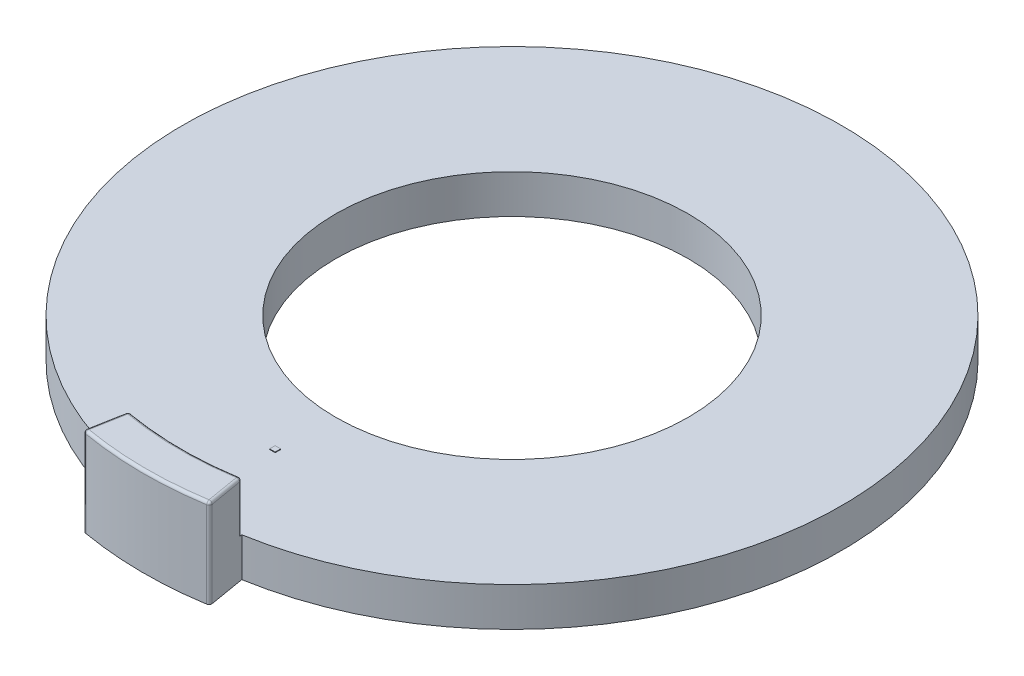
ISO-10303-21;
HEADER;
FILE_DESCRIPTION(('STEP AP214'),'2;1');
FILE_NAME('part.step','',(''),(''),'','','');
FILE_SCHEMA(('AUTOMOTIVE_DESIGN { 1 0 10303 214 1 1 1 1 }'));
ENDSEC;
DATA;
#1=APPLICATION_CONTEXT('core data for automotive mechanical design processes');
#2=APPLICATION_PROTOCOL_DEFINITION('international standard','automotive_design',2000,#1);
#3=PRODUCT_CONTEXT('',#1,'mechanical');
#4=PRODUCT('Part','Part','',(#3));
#5=PRODUCT_RELATED_PRODUCT_CATEGORY('part','',(#4));
#6=PRODUCT_DEFINITION_FORMATION('','',#4);
#7=PRODUCT_DEFINITION_CONTEXT('part definition',#1,'design');
#8=PRODUCT_DEFINITION('design','',#6,#7);
#9=PRODUCT_DEFINITION_SHAPE('','',#8);
#10=(LENGTH_UNIT() NAMED_UNIT(*) SI_UNIT(.MILLI.,.METRE.));
#11=(NAMED_UNIT(*) PLANE_ANGLE_UNIT() SI_UNIT($,.RADIAN.));
#12=(NAMED_UNIT(*) SI_UNIT($,.STERADIAN.) SOLID_ANGLE_UNIT());
#13=UNCERTAINTY_MEASURE_WITH_UNIT(LENGTH_MEASURE(1.E-05),#10,'distance_accuracy_value','');
#14=(GEOMETRIC_REPRESENTATION_CONTEXT(3) GLOBAL_UNCERTAINTY_ASSIGNED_CONTEXT((#13)) GLOBAL_UNIT_ASSIGNED_CONTEXT((#10,
#11,#12)) REPRESENTATION_CONTEXT('',''));
#15=CARTESIAN_POINT('',(0.,0.,0.));
#16=DIRECTION('',(0.,0.,1.));
#17=DIRECTION('',(1.,0.,0.));
#18=AXIS2_PLACEMENT_3D('',#15,#16,#17);
#19=CARTESIAN_POINT('',(0.,0.7,0.));
#20=DIRECTION('',(0.,1.,0.));
#21=DIRECTION('',(0.,0.,1.));
#22=AXIS2_PLACEMENT_3D('',#19,#20,#21);
#23=PLANE('',#22);
#24=CARTESIAN_POINT('',(0.,0.7,0.));
#25=DIRECTION('',(0.,1.,0.));
#26=DIRECTION('',(0.,0.,1.));
#27=AXIS2_PLACEMENT_3D('',#24,#25,#26);
#28=CIRCLE('',#27,3.175);
#29=CARTESIAN_POINT('',(0.,0.7,3.175));
#30=VERTEX_POINT('',#29);
#31=EDGE_CURVE('E196',#30,#30,#28,.T.);
#32=ORIENTED_EDGE('',*,*,#31,.F.);
#33=EDGE_LOOP('',(#32));
#34=FACE_BOUND('',#33,.T.);
#35=DIRECTION('',(-1.,0.,0.));
#36=VECTOR('',#35,1.);
#37=CARTESIAN_POINT('',(-0.0937750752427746,0.7,4.17188014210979));
#38=LINE('',#37,#36);
#39=CARTESIAN_POINT('',(0.00622492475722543,0.7,4.17188014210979));
#40=VERTEX_POINT('',#39);
#41=CARTESIAN_POINT('',(-0.0937750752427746,0.7,4.17188014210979));
#42=VERTEX_POINT('',#41);
#43=EDGE_CURVE('E227',#40,#42,#38,.T.);
#44=ORIENTED_EDGE('',*,*,#43,.F.);
#45=DIRECTION('',(0.,0.,-1.));
#46=VECTOR('',#45,1.);
#47=CARTESIAN_POINT('',(0.00622492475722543,0.7,4.17188014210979));
#48=LINE('',#47,#46);
#49=CARTESIAN_POINT('',(0.00622492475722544,0.7,4.27188014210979));
#50=VERTEX_POINT('',#49);
#51=EDGE_CURVE('E212',#50,#40,#48,.T.);
#52=ORIENTED_EDGE('',*,*,#51,.F.);
#53=DIRECTION('',(1.,0.,0.));
#54=VECTOR('',#53,1.);
#55=CARTESIAN_POINT('',(-0.0937750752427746,0.7,4.27188014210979));
#56=LINE('',#55,#54);
#57=CARTESIAN_POINT('',(-0.0937750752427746,0.7,4.27188014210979));
#58=VERTEX_POINT('',#57);
#59=EDGE_CURVE('E218',#58,#50,#56,.T.);
#60=ORIENTED_EDGE('',*,*,#59,.F.);
#61=DIRECTION('',(0.,0.,1.));
#62=VECTOR('',#61,1.);
#63=CARTESIAN_POINT('',(-0.0937750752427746,0.7,4.17188014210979));
#64=LINE('',#63,#62);
#65=EDGE_CURVE('E229',#42,#58,#64,.T.);
#66=ORIENTED_EDGE('',*,*,#65,.F.);
#67=EDGE_LOOP('',(#44,#52,#60,#66));
#68=FACE_BOUND('',#67,.T.);
#69=CARTESIAN_POINT('',(0.,0.7,0.));
#70=DIRECTION('',(0.,1.,0.));
#71=DIRECTION('',(0.,0.,1.));
#72=AXIS2_PLACEMENT_3D('',#69,#70,#71);
#73=CIRCLE('',#72,5.935);
#74=CARTESIAN_POINT('',(0.98573466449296,0.7,5.85256799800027));
#75=VERTEX_POINT('',#74);
#76=CARTESIAN_POINT('',(-1.06389441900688,0.7,5.8388657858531));
#77=VERTEX_POINT('',#76);
#78=EDGE_CURVE('E195',#75,#77,#73,.T.);
#79=ORIENTED_EDGE('',*,*,#78,.T.);
#80=DIRECTION('',(-0.179257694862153,0.,0.983802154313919));
#81=VECTOR('',#80,1.);
#82=CARTESIAN_POINT('',(-1.06389441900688,0.7,5.83886578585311));
#83=LINE('',#82,#81);
#84=CARTESIAN_POINT('',(-1.07281986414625,0.7,5.88785041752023));
#85=VERTEX_POINT('',#84);
#86=EDGE_CURVE('E293',#85,#77,#83,.F.);
#87=ORIENTED_EDGE('',*,*,#86,.F.);
#88=CARTESIAN_POINT('',(-1.02362975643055,0.7,5.89681330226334));
#89=DIRECTION('',(0.,1.,0.));
#90=DIRECTION('',(0.,0.,1.));
#91=AXIS2_PLACEMENT_3D('',#88,#89,#90);
#92=CIRCLE('',#91,0.05);
#93=CARTESIAN_POINT('',(-1.0150781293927,0.7,5.84755003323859));
#94=VERTEX_POINT('',#93);
#95=EDGE_CURVE('E69',#85,#94,#92,.F.);
#96=ORIENTED_EDGE('',*,*,#95,.T.);
#97=CARTESIAN_POINT('',(0.,0.7,0.));
#98=DIRECTION('',(0.,-1.,0.));
#99=DIRECTION('',(0.,0.,1.));
#100=AXIS2_PLACEMENT_3D('',#97,#98,#99);
#101=CIRCLE('',#100,5.935);
#102=CARTESIAN_POINT('',(0.936806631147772,0.7,5.86059880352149));
#103=VERTEX_POINT('',#102);
#104=EDGE_CURVE('E208',#103,#94,#101,.T.);
#105=ORIENTED_EDGE('',*,*,#104,.F.);
#106=CARTESIAN_POINT('',(0.944698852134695,0.7,5.90997200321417));
#107=DIRECTION('',(0.,1.,0.));
#108=DIRECTION('',(0.,0.,1.));
#109=AXIS2_PLACEMENT_3D('',#106,#107,#108);
#110=CIRCLE('',#109,0.05);
#111=CARTESIAN_POINT('',(0.994004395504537,0.7,5.90166758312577));
#112=VERTEX_POINT('',#111);
#113=EDGE_CURVE('E13',#103,#112,#110,.F.);
#114=ORIENTED_EDGE('',*,*,#113,.T.);
#115=DIRECTION('',(-0.16608840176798,0.,-0.986110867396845));
#116=VECTOR('',#115,1.);
#117=CARTESIAN_POINT('',(0.98573466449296,0.7,5.85256799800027));
#118=LINE('',#117,#116);
#119=EDGE_CURVE('E76',#75,#112,#118,.F.);
#120=ORIENTED_EDGE('',*,*,#119,.F.);
#121=EDGE_LOOP('',(#79,#87,#96,#105,#114,#120));
#122=FACE_BOUND('',#121,.T.);
#123=ADVANCED_FACE('F60',(#34,#68,#122),#23,.T.);
#124=CARTESIAN_POINT('',(0.,0.,0.));
#125=DIRECTION('',(0.,1.,0.));
#126=DIRECTION('',(0.,0.,1.));
#127=AXIS2_PLACEMENT_3D('',#124,#125,#126);
#128=PLANE('',#127);
#129=CARTESIAN_POINT('',(0.,0.,0.));
#130=DIRECTION('',(0.,-1.,0.));
#131=DIRECTION('',(0.,0.,-1.));
#132=AXIS2_PLACEMENT_3D('',#129,#130,#131);
#133=CIRCLE('',#132,6.635);
#134=CARTESIAN_POINT('',(-1.13977690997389,0.,6.53637006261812));
#135=VERTEX_POINT('',#134);
#136=CARTESIAN_POINT('',(1.05228485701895,0.,6.55102446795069));
#137=VERTEX_POINT('',#136);
#138=EDGE_CURVE('E200',#135,#137,#133,.F.);
#139=ORIENTED_EDGE('',*,*,#138,.F.);
#140=CARTESIAN_POINT('',(-1.13118778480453,0.,6.48711331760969));
#141=DIRECTION('',(0.,1.,0.));
#142=DIRECTION('',(0.,0.,1.));
#143=AXIS2_PLACEMENT_3D('',#140,#141,#142);
#144=CIRCLE('',#143,0.05);
#145=CARTESIAN_POINT('',(-1.18037789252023,0.,6.47815043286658));
#146=VERTEX_POINT('',#145);
#147=EDGE_CURVE('E308',#135,#146,#144,.F.);
#148=ORIENTED_EDGE('',*,*,#147,.T.);
#149=DIRECTION('',(0.179257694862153,0.,-0.983802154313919));
#150=VECTOR('',#149,1.);
#151=CARTESIAN_POINT('',(-1.06389441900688,0.,5.83886578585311));
#152=LINE('',#151,#150);
#153=CARTESIAN_POINT('',(-1.06389441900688,0.,5.83886578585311));
#154=VERTEX_POINT('',#153);
#155=EDGE_CURVE('E183',#146,#154,#152,.T.);
#156=ORIENTED_EDGE('',*,*,#155,.T.);
#157=CARTESIAN_POINT('',(0.,0.,0.));
#158=DIRECTION('',(0.,1.,0.));
#159=DIRECTION('',(0.,0.,1.));
#160=AXIS2_PLACEMENT_3D('',#157,#158,#159);
#161=CIRCLE('',#160,5.935);
#162=CARTESIAN_POINT('',(0.985734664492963,0.,5.85256799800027));
#163=VERTEX_POINT('',#162);
#164=EDGE_CURVE('E187',#163,#154,#161,.T.);
#165=ORIENTED_EDGE('',*,*,#164,.F.);
#166=DIRECTION('',(-0.16608840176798,0.,-0.986110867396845));
#167=VECTOR('',#166,1.);
#168=CARTESIAN_POINT('',(0.985734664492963,0.,5.85256799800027));
#169=LINE('',#168,#167);
#170=CARTESIAN_POINT('',(1.09366059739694,0.,6.49335287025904));
#171=VERTEX_POINT('',#170);
#172=EDGE_CURVE('E172',#171,#163,#169,.T.);
#173=ORIENTED_EDGE('',*,*,#172,.F.);
#174=CARTESIAN_POINT('',(1.0443550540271,0.,6.50165729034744));
#175=DIRECTION('',(0.,1.,0.));
#176=DIRECTION('',(0.,0.,1.));
#177=AXIS2_PLACEMENT_3D('',#174,#175,#176);
#178=CIRCLE('',#177,0.05);
#179=EDGE_CURVE('E306',#171,#137,#178,.F.);
#180=ORIENTED_EDGE('',*,*,#179,.T.);
#181=EDGE_LOOP('',(#139,#148,#156,#165,#173,#180));
#182=FACE_BOUND('',#181,.T.);
#183=CARTESIAN_POINT('',(0.,0.,0.));
#184=DIRECTION('',(0.,1.,0.));
#185=DIRECTION('',(0.,0.,1.));
#186=AXIS2_PLACEMENT_3D('',#183,#184,#185);
#187=CIRCLE('',#186,3.175);
#188=CARTESIAN_POINT('',(0.,0.,3.175));
#189=VERTEX_POINT('',#188);
#190=EDGE_CURVE('E242',#189,#189,#187,.T.);
#191=ORIENTED_EDGE('',*,*,#190,.T.);
#192=EDGE_LOOP('',(#191));
#193=FACE_BOUND('',#192,.T.);
#194=ADVANCED_FACE('F189',(#182,#193),#128,.F.);
#195=CARTESIAN_POINT('',(0.,0.7,0.));
#196=DIRECTION('',(0.,-1.,0.));
#197=DIRECTION('',(0.,0.,-1.));
#198=AXIS2_PLACEMENT_3D('',#195,#196,#197);
#199=CYLINDRICAL_SURFACE('',#198,5.935);
#200=ORIENTED_EDGE('',*,*,#164,.T.);
#201=DIRECTION('',(0.,1.,0.));
#202=VECTOR('',#201,1.);
#203=CARTESIAN_POINT('',(-1.06389441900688,0.,5.83886578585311));
#204=LINE('',#203,#202);
#205=EDGE_CURVE('E184',#154,#77,#204,.T.);
#206=ORIENTED_EDGE('',*,*,#205,.T.);
#207=ORIENTED_EDGE('',*,*,#78,.F.);
#208=DIRECTION('',(0.,-1.,0.));
#209=VECTOR('',#208,1.);
#210=CARTESIAN_POINT('',(0.98573466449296,0.700000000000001,5.85256799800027));
#211=LINE('',#210,#209);
#212=EDGE_CURVE('E176',#75,#163,#211,.T.);
#213=ORIENTED_EDGE('',*,*,#212,.T.);
#214=EDGE_LOOP('',(#200,#206,#207,#213));
#215=FACE_BOUND('',#214,.T.);
#216=ADVANCED_FACE('F198',(#215),#199,.T.);
#217=CARTESIAN_POINT('',(0.,0.7,0.));
#218=DIRECTION('',(0.,-1.,0.));
#219=DIRECTION('',(0.,0.,-1.));
#220=AXIS2_PLACEMENT_3D('',#217,#218,#219);
#221=CYLINDRICAL_SURFACE('',#220,3.175);
#222=ORIENTED_EDGE('',*,*,#31,.T.);
#223=EDGE_LOOP('',(#222));
#224=FACE_BOUND('',#223,.T.);
#225=ORIENTED_EDGE('',*,*,#190,.F.);
#226=EDGE_LOOP('',(#225));
#227=FACE_BOUND('',#226,.T.);
#228=ADVANCED_FACE('F400',(#224,#227),#221,.F.);
#229=CARTESIAN_POINT('',(0.00622492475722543,0.71,4.17188014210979));
#230=DIRECTION('',(-1.,0.,0.));
#231=DIRECTION('',(0.,0.,1.));
#232=AXIS2_PLACEMENT_3D('',#229,#230,#231);
#233=PLANE('',#232);
#234=ORIENTED_EDGE('',*,*,#51,.T.);
#235=DIRECTION('',(0.,-1.,0.));
#236=VECTOR('',#235,1.);
#237=CARTESIAN_POINT('',(0.00622492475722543,0.71,4.17188014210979));
#238=LINE('',#237,#236);
#239=CARTESIAN_POINT('',(0.00622492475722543,0.71,4.17188014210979));
#240=VERTEX_POINT('',#239);
#241=EDGE_CURVE('E240',#240,#40,#238,.T.);
#242=ORIENTED_EDGE('',*,*,#241,.F.);
#243=DIRECTION('',(0.,0.,-1.));
#244=VECTOR('',#243,1.);
#245=CARTESIAN_POINT('',(0.00622492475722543,0.71,4.17188014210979));
#246=LINE('',#245,#244);
#247=CARTESIAN_POINT('',(0.00622492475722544,0.71,4.27188014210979));
#248=VERTEX_POINT('',#247);
#249=EDGE_CURVE('E214',#248,#240,#246,.T.);
#250=ORIENTED_EDGE('',*,*,#249,.F.);
#251=DIRECTION('',(0.,-1.,0.));
#252=VECTOR('',#251,1.);
#253=CARTESIAN_POINT('',(0.00622492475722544,0.71,4.27188014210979));
#254=LINE('',#253,#252);
#255=EDGE_CURVE('E224',#248,#50,#254,.T.);
#256=ORIENTED_EDGE('',*,*,#255,.T.);
#257=EDGE_LOOP('',(#234,#242,#250,#256));
#258=FACE_BOUND('',#257,.T.);
#259=ADVANCED_FACE('F554',(#258),#233,.F.);
#260=CARTESIAN_POINT('',(-0.0937750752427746,0.71,4.17188014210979));
#261=DIRECTION('',(0.,0.,1.));
#262=DIRECTION('',(1.,0.,0.));
#263=AXIS2_PLACEMENT_3D('',#260,#261,#262);
#264=PLANE('',#263);
#265=ORIENTED_EDGE('',*,*,#43,.T.);
#266=DIRECTION('',(0.,-1.,0.));
#267=VECTOR('',#266,1.);
#268=CARTESIAN_POINT('',(-0.0937750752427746,0.71,4.17188014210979));
#269=LINE('',#268,#267);
#270=CARTESIAN_POINT('',(-0.0937750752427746,0.71,4.17188014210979));
#271=VERTEX_POINT('',#270);
#272=EDGE_CURVE('E237',#271,#42,#269,.T.);
#273=ORIENTED_EDGE('',*,*,#272,.F.);
#274=DIRECTION('',(-1.,0.,0.));
#275=VECTOR('',#274,1.);
#276=CARTESIAN_POINT('',(-0.0937750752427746,0.71,4.17188014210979));
#277=LINE('',#276,#275);
#278=EDGE_CURVE('E217',#240,#271,#277,.T.);
#279=ORIENTED_EDGE('',*,*,#278,.F.);
#280=ORIENTED_EDGE('',*,*,#241,.T.);
#281=EDGE_LOOP('',(#265,#273,#279,#280));
#282=FACE_BOUND('',#281,.T.);
#283=ADVANCED_FACE('F544',(#282),#264,.F.);
#284=CARTESIAN_POINT('',(-0.0937750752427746,0.71,4.17188014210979));
#285=DIRECTION('',(1.,0.,0.));
#286=DIRECTION('',(0.,0.,-1.));
#287=AXIS2_PLACEMENT_3D('',#284,#285,#286);
#288=PLANE('',#287);
#289=ORIENTED_EDGE('',*,*,#65,.T.);
#290=DIRECTION('',(0.,-1.,0.));
#291=VECTOR('',#290,1.);
#292=CARTESIAN_POINT('',(-0.0937750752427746,0.71,4.27188014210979));
#293=LINE('',#292,#291);
#294=CARTESIAN_POINT('',(-0.0937750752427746,0.71,4.27188014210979));
#295=VERTEX_POINT('',#294);
#296=EDGE_CURVE('E235',#295,#58,#293,.T.);
#297=ORIENTED_EDGE('',*,*,#296,.F.);
#298=DIRECTION('',(0.,0.,1.));
#299=VECTOR('',#298,1.);
#300=CARTESIAN_POINT('',(-0.0937750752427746,0.71,4.17188014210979));
#301=LINE('',#300,#299);
#302=EDGE_CURVE('E220',#271,#295,#301,.T.);
#303=ORIENTED_EDGE('',*,*,#302,.F.);
#304=ORIENTED_EDGE('',*,*,#272,.T.);
#305=EDGE_LOOP('',(#289,#297,#303,#304));
#306=FACE_BOUND('',#305,.T.);
#307=ADVANCED_FACE('F534',(#306),#288,.F.);
#308=CARTESIAN_POINT('',(-0.0937750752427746,0.71,4.27188014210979));
#309=DIRECTION('',(0.,0.,-1.));
#310=DIRECTION('',(-1.,0.,0.));
#311=AXIS2_PLACEMENT_3D('',#308,#309,#310);
#312=PLANE('',#311);
#313=ORIENTED_EDGE('',*,*,#59,.T.);
#314=ORIENTED_EDGE('',*,*,#255,.F.);
#315=DIRECTION('',(1.,0.,0.));
#316=VECTOR('',#315,1.);
#317=CARTESIAN_POINT('',(-0.0937750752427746,0.71,4.27188014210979));
#318=LINE('',#317,#316);
#319=EDGE_CURVE('E222',#295,#248,#318,.T.);
#320=ORIENTED_EDGE('',*,*,#319,.F.);
#321=ORIENTED_EDGE('',*,*,#296,.T.);
#322=EDGE_LOOP('',(#313,#314,#320,#321));
#323=FACE_BOUND('',#322,.T.);
#324=ADVANCED_FACE('F387',(#323),#312,.F.);
#325=CARTESIAN_POINT('',(0.,0.71,0.));
#326=DIRECTION('',(0.,1.,0.));
#327=DIRECTION('',(0.,0.,1.));
#328=AXIS2_PLACEMENT_3D('',#325,#326,#327);
#329=PLANE('',#328);
#330=ORIENTED_EDGE('',*,*,#249,.T.);
#331=ORIENTED_EDGE('',*,*,#278,.T.);
#332=ORIENTED_EDGE('',*,*,#302,.T.);
#333=ORIENTED_EDGE('',*,*,#319,.T.);
#334=EDGE_LOOP('',(#330,#331,#332,#333));
#335=FACE_BOUND('',#334,.T.);
#336=ADVANCED_FACE('F380',(#335),#329,.T.);
#337=CARTESIAN_POINT('',(-1.06389441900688,0.35,5.83886578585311));
#338=DIRECTION('',(0.983802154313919,0.,0.179257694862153));
#339=DIRECTION('',(0.,1.,0.));
#340=AXIS2_PLACEMENT_3D('',#337,#338,#339);
#341=PLANE('',#340);
#342=DIRECTION('',(-0.179257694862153,0.,0.983802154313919));
#343=VECTOR('',#342,1.);
#344=CARTESIAN_POINT('',(-1.06389441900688,1.55,5.83886578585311));
#345=LINE('',#344,#343);
#346=CARTESIAN_POINT('',(-1.18037789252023,1.55,6.47815043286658));
#347=VERTEX_POINT('',#346);
#348=CARTESIAN_POINT('',(-1.07281986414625,1.55,5.88785041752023));
#349=VERTEX_POINT('',#348);
#350=EDGE_CURVE('E260',#347,#349,#345,.F.);
#351=ORIENTED_EDGE('',*,*,#350,.T.);
#352=DIRECTION('',(0.,-1.,0.));
#353=VECTOR('',#352,1.);
#354=CARTESIAN_POINT('',(-1.07281986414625,0.7,5.88785041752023));
#355=LINE('',#354,#353);
#356=EDGE_CURVE('E295',#349,#85,#355,.T.);
#357=ORIENTED_EDGE('',*,*,#356,.T.);
#358=ORIENTED_EDGE('',*,*,#86,.T.);
#359=ORIENTED_EDGE('',*,*,#205,.F.);
#360=ORIENTED_EDGE('',*,*,#155,.F.);
#361=DIRECTION('',(0.,-1.,0.));
#362=VECTOR('',#361,1.);
#363=CARTESIAN_POINT('',(-1.18037789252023,1.55,6.47815043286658));
#364=LINE('',#363,#362);
#365=EDGE_CURVE('E291',#146,#347,#364,.F.);
#366=ORIENTED_EDGE('',*,*,#365,.T.);
#367=EDGE_LOOP('',(#351,#357,#358,#359,#360,#366));
#368=FACE_BOUND('',#367,.T.);
#369=ADVANCED_FACE('F378',(#368),#341,.F.);
#370=CARTESIAN_POINT('',(0.98573466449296,0.35,5.85256799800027));
#371=DIRECTION('',(-0.986110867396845,0.,0.16608840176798));
#372=DIRECTION('',(0.,-1.,0.));
#373=AXIS2_PLACEMENT_3D('',#370,#371,#372);
#374=PLANE('',#373);
#375=ORIENTED_EDGE('',*,*,#212,.F.);
#376=ORIENTED_EDGE('',*,*,#119,.T.);
#377=DIRECTION('',(0.,-1.,0.));
#378=VECTOR('',#377,1.);
#379=CARTESIAN_POINT('',(0.994004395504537,1.55,5.90166758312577));
#380=LINE('',#379,#378);
#381=CARTESIAN_POINT('',(0.994004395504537,1.55,5.90166758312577));
#382=VERTEX_POINT('',#381);
#383=EDGE_CURVE('E311',#112,#382,#380,.F.);
#384=ORIENTED_EDGE('',*,*,#383,.T.);
#385=DIRECTION('',(-0.16608840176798,0.,-0.986110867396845));
#386=VECTOR('',#385,1.);
#387=CARTESIAN_POINT('',(0.98573466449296,1.55,5.85256799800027));
#388=LINE('',#387,#386);
#389=CARTESIAN_POINT('',(1.09366059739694,1.55,6.49335287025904));
#390=VERTEX_POINT('',#389);
#391=EDGE_CURVE('E266',#382,#390,#388,.F.);
#392=ORIENTED_EDGE('',*,*,#391,.T.);
#393=DIRECTION('',(0.,-1.,0.));
#394=VECTOR('',#393,1.);
#395=CARTESIAN_POINT('',(1.09366059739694,0.,6.49335287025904));
#396=LINE('',#395,#394);
#397=EDGE_CURVE('E180',#390,#171,#396,.T.);
#398=ORIENTED_EDGE('',*,*,#397,.T.);
#399=ORIENTED_EDGE('',*,*,#172,.T.);
#400=EDGE_LOOP('',(#375,#376,#384,#392,#398,#399));
#401=FACE_BOUND('',#400,.T.);
#402=ADVANCED_FACE('F174',(#401),#374,.F.);
#403=CARTESIAN_POINT('',(0.,0.7,0.));
#404=DIRECTION('',(0.,-1.,0.));
#405=DIRECTION('',(0.,0.,-1.));
#406=AXIS2_PLACEMENT_3D('',#403,#404,#405);
#407=CYLINDRICAL_SURFACE('',#406,6.635);
#408=CARTESIAN_POINT('',(0.,1.55,0.));
#409=DIRECTION('',(0.,1.,0.));
#410=DIRECTION('',(0.,0.,1.));
#411=AXIS2_PLACEMENT_3D('',#408,#409,#410);
#412=CIRCLE('',#411,6.635);
#413=CARTESIAN_POINT('',(1.05228485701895,1.55,6.55102446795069));
#414=VERTEX_POINT('',#413);
#415=CARTESIAN_POINT('',(-1.13977690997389,1.55,6.53637006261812));
#416=VERTEX_POINT('',#415);
#417=EDGE_CURVE('E268',#414,#416,#412,.F.);
#418=ORIENTED_EDGE('',*,*,#417,.T.);
#419=DIRECTION('',(0.,-1.,0.));
#420=VECTOR('',#419,1.);
#421=CARTESIAN_POINT('',(-1.13977690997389,0.7,6.53637006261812));
#422=LINE('',#421,#420);
#423=EDGE_CURVE('E304',#416,#135,#422,.T.);
#424=ORIENTED_EDGE('',*,*,#423,.T.);
#425=ORIENTED_EDGE('',*,*,#138,.T.);
#426=DIRECTION('',(0.,-1.,0.));
#427=VECTOR('',#426,1.);
#428=CARTESIAN_POINT('',(1.05228485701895,0.7,6.55102446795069));
#429=LINE('',#428,#427);
#430=EDGE_CURVE('E302',#137,#414,#429,.F.);
#431=ORIENTED_EDGE('',*,*,#430,.T.);
#432=EDGE_LOOP('',(#418,#424,#425,#431));
#433=FACE_BOUND('',#432,.T.);
#434=ADVANCED_FACE('F334',(#433),#407,.T.);
#435=CARTESIAN_POINT('',(0.,1.6,0.));
#436=DIRECTION('',(0.,-1.,0.));
#437=DIRECTION('',(0.,0.,-1.));
#438=AXIS2_PLACEMENT_3D('',#435,#436,#437);
#439=CYLINDRICAL_SURFACE('',#438,5.935);
#440=ORIENTED_EDGE('',*,*,#104,.T.);
#441=DIRECTION('',(0.,-1.,0.));
#442=VECTOR('',#441,1.);
#443=CARTESIAN_POINT('',(-1.0150781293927,1.6,5.84755003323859));
#444=LINE('',#443,#442);
#445=CARTESIAN_POINT('',(-1.0150781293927,1.55,5.84755003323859));
#446=VERTEX_POINT('',#445);
#447=EDGE_CURVE('E300',#94,#446,#444,.F.);
#448=ORIENTED_EDGE('',*,*,#447,.T.);
#449=CARTESIAN_POINT('',(0.,1.55,0.));
#450=DIRECTION('',(0.,1.,0.));
#451=DIRECTION('',(0.,0.,1.));
#452=AXIS2_PLACEMENT_3D('',#449,#450,#451);
#453=CIRCLE('',#452,5.935);
#454=CARTESIAN_POINT('',(0.936806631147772,1.55,5.86059880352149));
#455=VERTEX_POINT('',#454);
#456=EDGE_CURVE('E263',#446,#455,#453,.T.);
#457=ORIENTED_EDGE('',*,*,#456,.T.);
#458=DIRECTION('',(0.,-1.,0.));
#459=VECTOR('',#458,1.);
#460=CARTESIAN_POINT('',(0.936806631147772,1.6,5.86059880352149));
#461=LINE('',#460,#459);
#462=EDGE_CURVE('E298',#455,#103,#461,.T.);
#463=ORIENTED_EDGE('',*,*,#462,.T.);
#464=EDGE_LOOP('',(#440,#448,#457,#463));
#465=FACE_BOUND('',#464,.T.);
#466=ADVANCED_FACE('F368',(#465),#439,.F.);
#467=CARTESIAN_POINT('',(0.,1.6,0.));
#468=DIRECTION('',(0.,1.,0.));
#469=DIRECTION('',(0.,0.,1.));
#470=AXIS2_PLACEMENT_3D('',#467,#468,#469);
#471=PLANE('',#470);
#472=CARTESIAN_POINT('',(0.,1.6,0.));
#473=DIRECTION('',(0.,1.,0.));
#474=DIRECTION('',(0.,0.,1.));
#475=AXIS2_PLACEMENT_3D('',#472,#473,#474);
#476=CIRCLE('',#475,5.985);
#477=CARTESIAN_POINT('',(0.944698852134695,1.6,5.90997200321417));
#478=VERTEX_POINT('',#477);
#479=CARTESIAN_POINT('',(-1.02362975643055,1.6,5.89681330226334));
#480=VERTEX_POINT('',#479);
#481=EDGE_CURVE('E254',#478,#480,#476,.F.);
#482=ORIENTED_EDGE('',*,*,#481,.T.);
#483=DIRECTION('',(0.179257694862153,0.,-0.983802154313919));
#484=VECTOR('',#483,1.);
#485=CARTESIAN_POINT('',(0.0491901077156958,1.6,0.00896288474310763));
#486=LINE('',#485,#484);
#487=CARTESIAN_POINT('',(-1.13118778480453,1.6,6.48711331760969));
#488=VERTEX_POINT('',#487);
#489=EDGE_CURVE('E257',#480,#488,#486,.F.);
#490=ORIENTED_EDGE('',*,*,#489,.T.);
#491=CARTESIAN_POINT('',(0.,1.6,0.));
#492=DIRECTION('',(0.,1.,0.));
#493=DIRECTION('',(0.,0.,1.));
#494=AXIS2_PLACEMENT_3D('',#491,#492,#493);
#495=CIRCLE('',#494,6.585);
#496=CARTESIAN_POINT('',(1.0443550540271,1.6,6.50165729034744));
#497=VERTEX_POINT('',#496);
#498=EDGE_CURVE('E247',#488,#497,#495,.T.);
#499=ORIENTED_EDGE('',*,*,#498,.T.);
#500=DIRECTION('',(0.16608840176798,0.,0.986110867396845));
#501=VECTOR('',#500,1.);
#502=CARTESIAN_POINT('',(-0.0493055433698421,1.6,0.00830442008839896));
#503=LINE('',#502,#501);
#504=EDGE_CURVE('E251',#497,#478,#503,.F.);
#505=ORIENTED_EDGE('',*,*,#504,.T.);
#506=EDGE_LOOP('',(#482,#490,#499,#505));
#507=FACE_BOUND('',#506,.T.);
#508=ADVANCED_FACE('F354',(#507),#471,.T.);
#509=CARTESIAN_POINT('',(-0.0493055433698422,1.55,0.00830442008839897));
#510=DIRECTION('',(0.16608840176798,0.,0.986110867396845));
#511=DIRECTION('',(0.986110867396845,0.,-0.16608840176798));
#512=AXIS2_PLACEMENT_3D('',#509,#510,#511);
#513=CYLINDRICAL_SURFACE('',#512,0.05);
#514=ORIENTED_EDGE('',*,*,#391,.F.);
#515=CARTESIAN_POINT('',(0.944698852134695,1.55,5.90997200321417));
#516=DIRECTION('',(0.16608840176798,0.,0.986110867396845));
#517=DIRECTION('',(0.986110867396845,0.,-0.16608840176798));
#518=AXIS2_PLACEMENT_3D('',#515,#516,#517);
#519=CIRCLE('',#518,0.05);
#520=EDGE_CURVE('E289',#382,#478,#519,.T.);
#521=ORIENTED_EDGE('',*,*,#520,.T.);
#522=ORIENTED_EDGE('',*,*,#504,.F.);
#523=CARTESIAN_POINT('',(1.0443550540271,1.55,6.50165729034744));
#524=DIRECTION('',(0.16608840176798,0.,0.986110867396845));
#525=DIRECTION('',(0.986110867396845,0.,-0.16608840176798));
#526=AXIS2_PLACEMENT_3D('',#523,#524,#525);
#527=CIRCLE('',#526,0.05);
#528=EDGE_CURVE('E287',#497,#390,#527,.F.);
#529=ORIENTED_EDGE('',*,*,#528,.T.);
#530=EDGE_LOOP('',(#514,#521,#522,#529));
#531=FACE_BOUND('',#530,.T.);
#532=ADVANCED_FACE('F411',(#531),#513,.T.);
#533=CARTESIAN_POINT('',(0.,1.55,0.));
#534=DIRECTION('',(0.,1.,0.));
#535=DIRECTION('',(0.,0.,1.));
#536=AXIS2_PLACEMENT_3D('',#533,#534,#535);
#537=TOROIDAL_SURFACE('',#536,5.985,0.05);
#538=ORIENTED_EDGE('',*,*,#456,.F.);
#539=CARTESIAN_POINT('',(-1.02362975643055,1.55,5.89681330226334));
#540=DIRECTION('',(0.985265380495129,0.,0.171032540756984));
#541=DIRECTION('',(0.171032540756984,0.,-0.985265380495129));
#542=AXIS2_PLACEMENT_3D('',#539,#540,#541);
#543=CIRCLE('',#542,0.05);
#544=EDGE_CURVE('E280',#446,#480,#543,.T.);
#545=ORIENTED_EDGE('',*,*,#544,.T.);
#546=ORIENTED_EDGE('',*,*,#481,.F.);
#547=CARTESIAN_POINT('',(0.944698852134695,1.55,5.90997200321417));
#548=DIRECTION('',(0.987463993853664,0.,-0.157844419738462));
#549=DIRECTION('',(-0.157844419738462,0.,-0.987463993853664));
#550=AXIS2_PLACEMENT_3D('',#547,#548,#549);
#551=CIRCLE('',#550,0.05);
#552=EDGE_CURVE('E277',#478,#455,#551,.F.);
#553=ORIENTED_EDGE('',*,*,#552,.T.);
#554=EDGE_LOOP('',(#538,#545,#546,#553));
#555=FACE_BOUND('',#554,.T.);
#556=ADVANCED_FACE('F358',(#555),#537,.T.);
#557=CARTESIAN_POINT('',(0.,1.55,0.));
#558=DIRECTION('',(0.,1.,0.));
#559=DIRECTION('',(0.,0.,1.));
#560=AXIS2_PLACEMENT_3D('',#557,#558,#559);
#561=TOROIDAL_SURFACE('',#560,6.585,0.05);
#562=ORIENTED_EDGE('',*,*,#498,.F.);
#563=CARTESIAN_POINT('',(-1.13118778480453,1.55,6.48711331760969));
#564=DIRECTION('',(0.985134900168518,0.,0.171782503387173));
#565=DIRECTION('',(0.171782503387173,0.,-0.985134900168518));
#566=AXIS2_PLACEMENT_3D('',#563,#564,#565);
#567=CIRCLE('',#566,0.05);
#568=EDGE_CURVE('E285',#488,#416,#567,.T.);
#569=ORIENTED_EDGE('',*,*,#568,.T.);
#570=ORIENTED_EDGE('',*,*,#417,.F.);
#571=CARTESIAN_POINT('',(1.0443550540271,1.55,6.50165729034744));
#572=DIRECTION('',(0.987343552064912,0.,-0.158596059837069));
#573=DIRECTION('',(-0.158596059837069,0.,-0.987343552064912));
#574=AXIS2_PLACEMENT_3D('',#571,#572,#573);
#575=CIRCLE('',#574,0.05);
#576=EDGE_CURVE('E282',#414,#497,#575,.F.);
#577=ORIENTED_EDGE('',*,*,#576,.T.);
#578=EDGE_LOOP('',(#562,#569,#570,#577));
#579=FACE_BOUND('',#578,.T.);
#580=ADVANCED_FACE('F351',(#579),#561,.T.);
#581=CARTESIAN_POINT('',(0.0491901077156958,1.55,0.00896288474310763));
#582=DIRECTION('',(0.179257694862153,0.,-0.983802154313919));
#583=DIRECTION('',(-0.983802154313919,0.,-0.179257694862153));
#584=AXIS2_PLACEMENT_3D('',#581,#582,#583);
#585=CYLINDRICAL_SURFACE('',#584,0.05);
#586=ORIENTED_EDGE('',*,*,#489,.F.);
#587=CARTESIAN_POINT('',(-1.02362975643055,1.55,5.89681330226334));
#588=DIRECTION('',(0.179257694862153,0.,-0.983802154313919));
#589=DIRECTION('',(-0.983802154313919,0.,-0.179257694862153));
#590=AXIS2_PLACEMENT_3D('',#587,#588,#589);
#591=CIRCLE('',#590,0.05);
#592=EDGE_CURVE('E274',#480,#349,#591,.F.);
#593=ORIENTED_EDGE('',*,*,#592,.T.);
#594=ORIENTED_EDGE('',*,*,#350,.F.);
#595=CARTESIAN_POINT('',(-1.13118778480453,1.55,6.48711331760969));
#596=DIRECTION('',(0.179257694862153,0.,-0.983802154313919));
#597=DIRECTION('',(-0.983802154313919,0.,-0.179257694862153));
#598=AXIS2_PLACEMENT_3D('',#595,#596,#597);
#599=CIRCLE('',#598,0.05);
#600=EDGE_CURVE('E271',#347,#488,#599,.T.);
#601=ORIENTED_EDGE('',*,*,#600,.T.);
#602=EDGE_LOOP('',(#586,#593,#594,#601));
#603=FACE_BOUND('',#602,.T.);
#604=ADVANCED_FACE('F348',(#603),#585,.T.);
#605=CARTESIAN_POINT('',(-1.02362975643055,1.6,5.89681330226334));
#606=DIRECTION('',(0.,-1.,0.));
#607=DIRECTION('',(0.,0.,-1.));
#608=AXIS2_PLACEMENT_3D('',#605,#606,#607);
#609=CYLINDRICAL_SURFACE('',#608,0.05);
#610=ORIENTED_EDGE('',*,*,#95,.F.);
#611=ORIENTED_EDGE('',*,*,#356,.F.);
#612=CARTESIAN_POINT('',(-1.02362975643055,1.55,5.89681330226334));
#613=DIRECTION('',(0.,1.,0.));
#614=DIRECTION('',(0.,0.,1.));
#615=AXIS2_PLACEMENT_3D('',#612,#613,#614);
#616=CIRCLE('',#615,0.05);
#617=EDGE_CURVE('E315',#446,#349,#616,.T.);
#618=ORIENTED_EDGE('',*,*,#617,.F.);
#619=ORIENTED_EDGE('',*,*,#447,.F.);
#620=EDGE_LOOP('',(#610,#611,#618,#619));
#621=FACE_BOUND('',#620,.T.);
#622=ADVANCED_FACE('F373',(#621),#609,.T.);
#623=CARTESIAN_POINT('',(-1.02362975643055,1.55,5.89681330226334));
#624=DIRECTION('',(0.,0.,1.));
#625=DIRECTION('',(1.,0.,0.));
#626=AXIS2_PLACEMENT_3D('',#623,#624,#625);
#627=SPHERICAL_SURFACE('',#626,0.05);
#628=ORIENTED_EDGE('',*,*,#592,.F.);
#629=ORIENTED_EDGE('',*,*,#544,.F.);
#630=ORIENTED_EDGE('',*,*,#617,.T.);
#631=EDGE_LOOP('',(#628,#629,#630));
#632=FACE_BOUND('',#631,.T.);
#633=ADVANCED_FACE('F376',(#632),#627,.T.);
#634=CARTESIAN_POINT('',(-1.13118778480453,0.7,6.48711331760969));
#635=DIRECTION('',(0.,-1.,0.));
#636=DIRECTION('',(0.,0.,-1.));
#637=AXIS2_PLACEMENT_3D('',#634,#635,#636);
#638=CYLINDRICAL_SURFACE('',#637,0.05);
#639=ORIENTED_EDGE('',*,*,#147,.F.);
#640=ORIENTED_EDGE('',*,*,#423,.F.);
#641=CARTESIAN_POINT('',(-1.13118778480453,1.55,6.48711331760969));
#642=DIRECTION('',(0.,1.,0.));
#643=DIRECTION('',(0.,0.,1.));
#644=AXIS2_PLACEMENT_3D('',#641,#642,#643);
#645=CIRCLE('',#644,0.05);
#646=EDGE_CURVE('E317',#347,#416,#645,.T.);
#647=ORIENTED_EDGE('',*,*,#646,.F.);
#648=ORIENTED_EDGE('',*,*,#365,.F.);
#649=EDGE_LOOP('',(#639,#640,#647,#648));
#650=FACE_BOUND('',#649,.T.);
#651=ADVANCED_FACE('F339',(#650),#638,.T.);
#652=CARTESIAN_POINT('',(-1.13118778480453,1.55,6.48711331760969));
#653=DIRECTION('',(0.,0.,1.));
#654=DIRECTION('',(1.,0.,0.));
#655=AXIS2_PLACEMENT_3D('',#652,#653,#654);
#656=SPHERICAL_SURFACE('',#655,0.05);
#657=ORIENTED_EDGE('',*,*,#646,.T.);
#658=ORIENTED_EDGE('',*,*,#568,.F.);
#659=ORIENTED_EDGE('',*,*,#600,.F.);
#660=EDGE_LOOP('',(#657,#658,#659));
#661=FACE_BOUND('',#660,.T.);
#662=ADVANCED_FACE('F343',(#661),#656,.T.);
#663=CARTESIAN_POINT('',(0.944698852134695,1.6,5.90997200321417));
#664=DIRECTION('',(0.,-1.,0.));
#665=DIRECTION('',(0.,0.,-1.));
#666=AXIS2_PLACEMENT_3D('',#663,#664,#665);
#667=CYLINDRICAL_SURFACE('',#666,0.05);
#668=ORIENTED_EDGE('',*,*,#113,.F.);
#669=ORIENTED_EDGE('',*,*,#462,.F.);
#670=CARTESIAN_POINT('',(0.944698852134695,1.55,5.90997200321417));
#671=DIRECTION('',(0.,1.,0.));
#672=DIRECTION('',(0.,0.,1.));
#673=AXIS2_PLACEMENT_3D('',#670,#671,#672);
#674=CIRCLE('',#673,0.05);
#675=EDGE_CURVE('E319',#382,#455,#674,.T.);
#676=ORIENTED_EDGE('',*,*,#675,.F.);
#677=ORIENTED_EDGE('',*,*,#383,.F.);
#678=EDGE_LOOP('',(#668,#669,#676,#677));
#679=FACE_BOUND('',#678,.T.);
#680=ADVANCED_FACE('F365',(#679),#667,.T.);
#681=CARTESIAN_POINT('',(0.944698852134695,1.55,5.90997200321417));
#682=DIRECTION('',(0.,0.,1.));
#683=DIRECTION('',(1.,0.,0.));
#684=AXIS2_PLACEMENT_3D('',#681,#682,#683);
#685=SPHERICAL_SURFACE('',#684,0.05);
#686=ORIENTED_EDGE('',*,*,#552,.F.);
#687=ORIENTED_EDGE('',*,*,#520,.F.);
#688=ORIENTED_EDGE('',*,*,#675,.T.);
#689=EDGE_LOOP('',(#686,#687,#688));
#690=FACE_BOUND('',#689,.T.);
#691=ADVANCED_FACE('F360',(#690),#685,.T.);
#692=CARTESIAN_POINT('',(1.0443550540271,0.7,6.50165729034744));
#693=DIRECTION('',(0.,-1.,0.));
#694=DIRECTION('',(0.,0.,-1.));
#695=AXIS2_PLACEMENT_3D('',#692,#693,#694);
#696=CYLINDRICAL_SURFACE('',#695,0.05);
#697=ORIENTED_EDGE('',*,*,#179,.F.);
#698=ORIENTED_EDGE('',*,*,#397,.F.);
#699=CARTESIAN_POINT('',(1.0443550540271,1.55,6.50165729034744));
#700=DIRECTION('',(0.,1.,0.));
#701=DIRECTION('',(0.,0.,1.));
#702=AXIS2_PLACEMENT_3D('',#699,#700,#701);
#703=CIRCLE('',#702,0.05);
#704=EDGE_CURVE('E64',#414,#390,#703,.T.);
#705=ORIENTED_EDGE('',*,*,#704,.F.);
#706=ORIENTED_EDGE('',*,*,#430,.F.);
#707=EDGE_LOOP('',(#697,#698,#705,#706));
#708=FACE_BOUND('',#707,.T.);
#709=ADVANCED_FACE('F62',(#708),#696,.T.);
#710=CARTESIAN_POINT('',(1.0443550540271,1.55,6.50165729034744));
#711=DIRECTION('',(0.,0.,1.));
#712=DIRECTION('',(1.,0.,0.));
#713=AXIS2_PLACEMENT_3D('',#710,#711,#712);
#714=SPHERICAL_SURFACE('',#713,0.05);
#715=ORIENTED_EDGE('',*,*,#704,.T.);
#716=ORIENTED_EDGE('',*,*,#528,.F.);
#717=ORIENTED_EDGE('',*,*,#576,.F.);
#718=EDGE_LOOP('',(#715,#716,#717));
#719=FACE_BOUND('',#718,.T.);
#720=ADVANCED_FACE('F329',(#719),#714,.T.);
#721=CLOSED_SHELL('',(#123,#194,#216,#228,#259,#283,#307,#324,#336,#369,#402,#434,#466,#508,
#532,#556,#580,#604,#622,#633,#651,#662,#680,#691,#709,#720));
#722=MANIFOLD_SOLID_BREP('B2',#721);
#723=ADVANCED_BREP_SHAPE_REPRESENTATION('',(#18,#722),#14);
#724=SHAPE_DEFINITION_REPRESENTATION(#9,#723);
ENDSEC;
END-ISO-10303-21;
